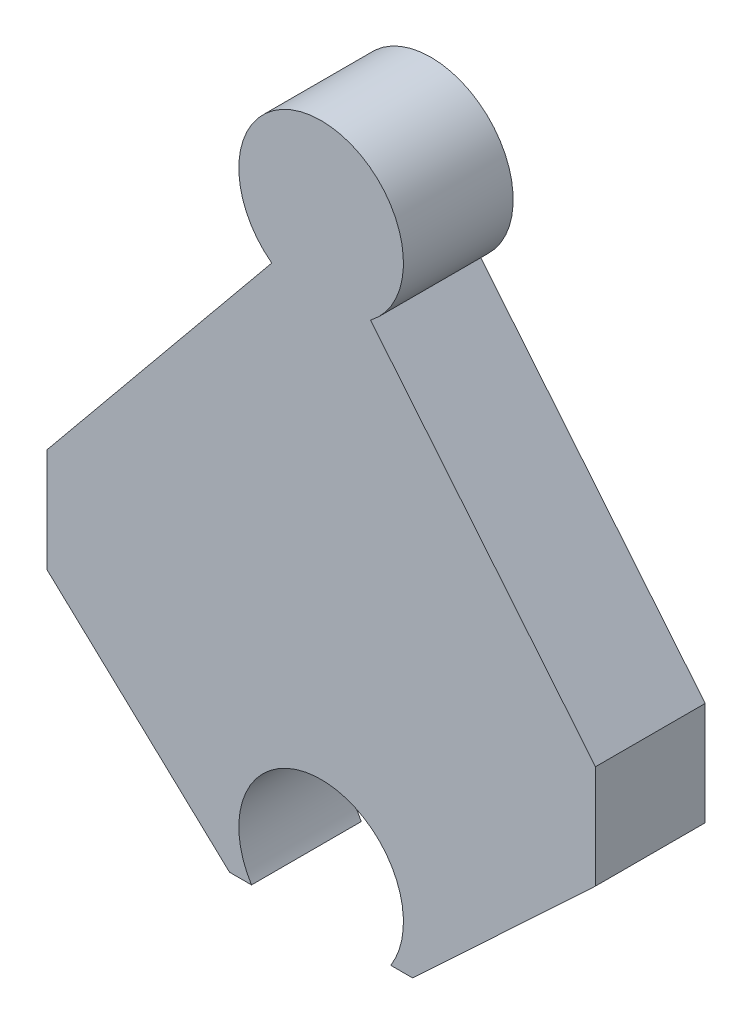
from build123d import *

# Parameters (mm, degrees)
LINEAR_AUSTRAGEN2_DEPTH = 10


with BuildPart() as part:
    # Skizze1 → Linear austragen2 (new body)
    with BuildSketch(Plane.XY):
        with BuildLine():
            Line((-4.5, 25), (-25, 0))
            Line((-25, 0), (-25, -9.421989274))
            Line((-25, -9.421989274), (-8.343951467, -25))
            Line((-8.343951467, -25), (-6.34428877, -25))
            ThreePointArc((-6.34428877, -25), (0, -13.5), (6.34428877, -25))
            Line((6.34428877, -25), (8.343951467, -25))
            Line((8.343951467, -25), (25, -9.421989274))
            Line((25, -9.421989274), (25, 0))
            Line((25, 0), (4.5, 25))
            ThreePointArc((4.5, 25), (0, 38.5), (-4.5, 25))
        make_face()
    extrude(amount=-LINEAR_AUSTRAGEN2_DEPTH)


solid = part.part
